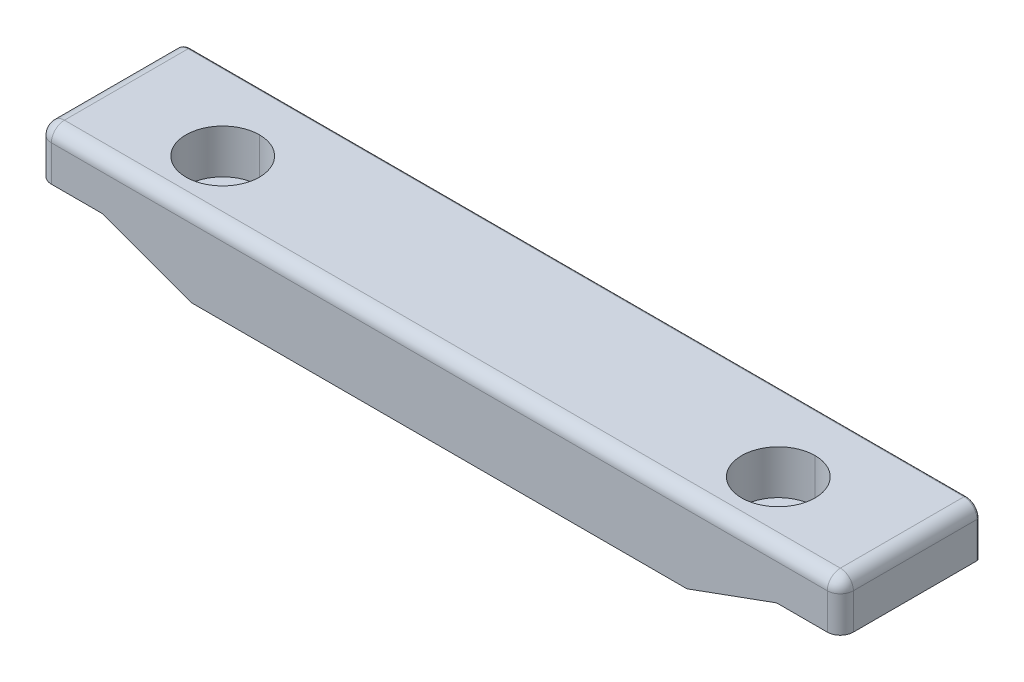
ISO-10303-21;
HEADER;
FILE_DESCRIPTION(('STEP AP214'),'2;1');
FILE_NAME('part.step','',(''),(''),'','','');
FILE_SCHEMA(('AUTOMOTIVE_DESIGN { 1 0 10303 214 1 1 1 1 }'));
ENDSEC;
DATA;
#1=APPLICATION_CONTEXT('core data for automotive mechanical design processes');
#2=APPLICATION_PROTOCOL_DEFINITION('international standard','automotive_design',2000,#1);
#3=PRODUCT_CONTEXT('',#1,'mechanical');
#4=PRODUCT('Part','Part','',(#3));
#5=PRODUCT_RELATED_PRODUCT_CATEGORY('part','',(#4));
#6=PRODUCT_DEFINITION_FORMATION('','',#4);
#7=PRODUCT_DEFINITION_CONTEXT('part definition',#1,'design');
#8=PRODUCT_DEFINITION('design','',#6,#7);
#9=PRODUCT_DEFINITION_SHAPE('','',#8);
#10=(LENGTH_UNIT() NAMED_UNIT(*) SI_UNIT(.MILLI.,.METRE.));
#11=(NAMED_UNIT(*) PLANE_ANGLE_UNIT() SI_UNIT($,.RADIAN.));
#12=(NAMED_UNIT(*) SI_UNIT($,.STERADIAN.) SOLID_ANGLE_UNIT());
#13=UNCERTAINTY_MEASURE_WITH_UNIT(LENGTH_MEASURE(1.E-05),#10,'distance_accuracy_value','');
#14=(GEOMETRIC_REPRESENTATION_CONTEXT(3) GLOBAL_UNCERTAINTY_ASSIGNED_CONTEXT((#13)) GLOBAL_UNIT_ASSIGNED_CONTEXT((#10,
#11,#12)) REPRESENTATION_CONTEXT('',''));
#15=CARTESIAN_POINT('',(0.,0.,0.));
#16=DIRECTION('',(0.,0.,1.));
#17=DIRECTION('',(1.,0.,0.));
#18=AXIS2_PLACEMENT_3D('',#15,#16,#17);
#19=CARTESIAN_POINT('',(-34.05,29.,1.025));
#20=DIRECTION('',(0.,1.,0.));
#21=DIRECTION('',(0.,0.,1.));
#22=AXIS2_PLACEMENT_3D('',#19,#20,#21);
#23=CYLINDRICAL_SURFACE('',#22,4.5);
#24=DIRECTION('',(0.,1.,0.));
#25=VECTOR('',#24,1.);
#26=CARTESIAN_POINT('',(-34.05,29.,-3.475));
#27=LINE('',#26,#25);
#28=CARTESIAN_POINT('',(-34.05,23.6,-3.475));
#29=VERTEX_POINT('',#28);
#30=CARTESIAN_POINT('',(-34.05,29.,-3.475));
#31=VERTEX_POINT('',#30);
#32=EDGE_CURVE('E229',#29,#31,#27,.T.);
#33=ORIENTED_EDGE('',*,*,#32,.F.);
#34=CARTESIAN_POINT('',(-34.05,23.6,1.025));
#35=DIRECTION('',(0.,1.,0.));
#36=DIRECTION('',(0.,0.,1.));
#37=AXIS2_PLACEMENT_3D('',#34,#35,#36);
#38=CIRCLE('',#37,4.5);
#39=CARTESIAN_POINT('',(-34.05,23.6,5.525));
#40=VERTEX_POINT('',#39);
#41=EDGE_CURVE('E10',#40,#29,#38,.T.);
#42=ORIENTED_EDGE('',*,*,#41,.F.);
#43=DIRECTION('',(0.,1.,0.));
#44=VECTOR('',#43,1.);
#45=CARTESIAN_POINT('',(-34.05,29.,5.525));
#46=LINE('',#45,#44);
#47=CARTESIAN_POINT('',(-34.05,29.,5.525));
#48=VERTEX_POINT('',#47);
#49=EDGE_CURVE('E238',#40,#48,#46,.T.);
#50=ORIENTED_EDGE('',*,*,#49,.T.);
#51=CARTESIAN_POINT('',(-34.05,29.,1.025));
#52=DIRECTION('',(0.,1.,0.));
#53=DIRECTION('',(0.,0.,1.));
#54=AXIS2_PLACEMENT_3D('',#51,#52,#53);
#55=CIRCLE('',#54,4.5);
#56=EDGE_CURVE('E230',#48,#31,#55,.T.);
#57=ORIENTED_EDGE('',*,*,#56,.T.);
#58=EDGE_LOOP('',(#33,#42,#50,#57));
#59=FACE_BOUND('',#58,.T.);
#60=ADVANCED_FACE('F15',(#59),#23,.F.);
#61=CARTESIAN_POINT('',(-31.3,23.6,1.025));
#62=DIRECTION('',(0.,-1.,0.));
#63=DIRECTION('',(0.,0.,-1.));
#64=AXIS2_PLACEMENT_3D('',#61,#62,#63);
#65=PLANE('',#64);
#66=CARTESIAN_POINT('',(-34.05,23.6,1.025));
#67=DIRECTION('',(0.,1.,0.));
#68=DIRECTION('',(0.,0.,1.));
#69=AXIS2_PLACEMENT_3D('',#66,#67,#68);
#70=CIRCLE('',#69,2.75);
#71=CARTESIAN_POINT('',(-34.05,23.6,3.775));
#72=VERTEX_POINT('',#71);
#73=CARTESIAN_POINT('',(-34.05,23.6,-1.725));
#74=VERTEX_POINT('',#73);
#75=EDGE_CURVE('E18',#72,#74,#70,.T.);
#76=ORIENTED_EDGE('',*,*,#75,.F.);
#77=CARTESIAN_POINT('',(-34.05,23.6,1.025));
#78=DIRECTION('',(0.,1.,0.));
#79=DIRECTION('',(0.,0.,1.));
#80=AXIS2_PLACEMENT_3D('',#77,#78,#79);
#81=CIRCLE('',#80,2.75);
#82=EDGE_CURVE('E285',#74,#72,#81,.T.);
#83=ORIENTED_EDGE('',*,*,#82,.F.);
#84=EDGE_LOOP('',(#76,#83));
#85=FACE_BOUND('',#84,.T.);
#86=ORIENTED_EDGE('',*,*,#41,.T.);
#87=CARTESIAN_POINT('',(-34.05,23.6,1.025));
#88=DIRECTION('',(0.,1.,0.));
#89=DIRECTION('',(0.,0.,1.));
#90=AXIS2_PLACEMENT_3D('',#87,#88,#89);
#91=CIRCLE('',#90,4.5);
#92=EDGE_CURVE('E224',#29,#40,#91,.T.);
#93=ORIENTED_EDGE('',*,*,#92,.T.);
#94=EDGE_LOOP('',(#86,#93));
#95=FACE_BOUND('',#94,.T.);
#96=ADVANCED_FACE('F222',(#85,#95),#65,.F.);
#97=CARTESIAN_POINT('',(-34.05,29.,1.025));
#98=DIRECTION('',(0.,1.,0.));
#99=DIRECTION('',(0.,0.,1.));
#100=AXIS2_PLACEMENT_3D('',#97,#98,#99);
#101=CYLINDRICAL_SURFACE('',#100,2.75);
#102=DIRECTION('',(0.,1.,0.));
#103=VECTOR('',#102,1.);
#104=CARTESIAN_POINT('',(-34.05,29.,-1.725));
#105=LINE('',#104,#103);
#106=CARTESIAN_POINT('',(-34.05,20.3520107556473,-1.725));
#107=VERTEX_POINT('',#106);
#108=EDGE_CURVE('E273',#107,#74,#105,.T.);
#109=ORIENTED_EDGE('',*,*,#108,.F.);
#110=CARTESIAN_POINT('',(-34.05,20.3520107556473,-1.725));
#111=CARTESIAN_POINT('',(-28.55,18.3501744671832,-1.725));
#112=CARTESIAN_POINT('',(-28.55,18.3501744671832,3.77499999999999));
#113=CARTESIAN_POINT('',(-34.05,20.3520107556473,3.775));
#114=(BOUNDED_CURVE() B_SPLINE_CURVE(3,(#110,#111,#112,#113),.UNSPECIFIED.,.F.,
.F.) B_SPLINE_CURVE_WITH_KNOTS((4,4),(1.5707963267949,4.71238898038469),
.UNSPECIFIED.) CURVE() GEOMETRIC_REPRESENTATION_ITEM() RATIONAL_B_SPLINE_CURVE((1.,
0.333333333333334,0.333333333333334,1.)) REPRESENTATION_ITEM(''));
#115=CARTESIAN_POINT('',(-34.05,20.3520107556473,3.775));
#116=VERTEX_POINT('',#115);
#117=EDGE_CURVE('E492',#107,#116,#114,.T.);
#118=ORIENTED_EDGE('',*,*,#117,.T.);
#119=DIRECTION('',(0.,1.,0.));
#120=VECTOR('',#119,1.);
#121=CARTESIAN_POINT('',(-34.05,29.,3.775));
#122=LINE('',#121,#120);
#123=EDGE_CURVE('E306',#116,#72,#122,.T.);
#124=ORIENTED_EDGE('',*,*,#123,.T.);
#125=ORIENTED_EDGE('',*,*,#75,.T.);
#126=EDGE_LOOP('',(#109,#118,#124,#125));
#127=FACE_BOUND('',#126,.T.);
#128=ADVANCED_FACE('F522',(#127),#101,.F.);
#129=CARTESIAN_POINT('',(34.05,29.,1.025));
#130=DIRECTION('',(0.,1.,0.));
#131=DIRECTION('',(0.,0.,1.));
#132=AXIS2_PLACEMENT_3D('',#129,#130,#131);
#133=CYLINDRICAL_SURFACE('',#132,4.5);
#134=DIRECTION('',(0.,1.,0.));
#135=VECTOR('',#134,1.);
#136=CARTESIAN_POINT('',(34.05,29.,-3.475));
#137=LINE('',#136,#135);
#138=CARTESIAN_POINT('',(34.05,23.6,-3.475));
#139=VERTEX_POINT('',#138);
#140=CARTESIAN_POINT('',(34.05,29.,-3.475));
#141=VERTEX_POINT('',#140);
#142=EDGE_CURVE('E249',#139,#141,#137,.T.);
#143=ORIENTED_EDGE('',*,*,#142,.F.);
#144=CARTESIAN_POINT('',(34.05,23.6,1.025));
#145=DIRECTION('',(0.,1.,0.));
#146=DIRECTION('',(0.,0.,1.));
#147=AXIS2_PLACEMENT_3D('',#144,#145,#146);
#148=CIRCLE('',#147,4.5);
#149=CARTESIAN_POINT('',(34.05,23.6,5.525));
#150=VERTEX_POINT('',#149);
#151=EDGE_CURVE('E383',#150,#139,#148,.T.);
#152=ORIENTED_EDGE('',*,*,#151,.F.);
#153=DIRECTION('',(0.,1.,0.));
#154=VECTOR('',#153,1.);
#155=CARTESIAN_POINT('',(34.05,29.,5.525));
#156=LINE('',#155,#154);
#157=CARTESIAN_POINT('',(34.05,29.,5.525));
#158=VERTEX_POINT('',#157);
#159=EDGE_CURVE('E264',#150,#158,#156,.T.);
#160=ORIENTED_EDGE('',*,*,#159,.T.);
#161=CARTESIAN_POINT('',(34.05,29.,1.025));
#162=DIRECTION('',(0.,1.,0.));
#163=DIRECTION('',(0.,0.,1.));
#164=AXIS2_PLACEMENT_3D('',#161,#162,#163);
#165=CIRCLE('',#164,4.5);
#166=EDGE_CURVE('E469',#158,#141,#165,.T.);
#167=ORIENTED_EDGE('',*,*,#166,.T.);
#168=EDGE_LOOP('',(#143,#152,#160,#167));
#169=FACE_BOUND('',#168,.T.);
#170=ADVANCED_FACE('F621',(#169),#133,.F.);
#171=CARTESIAN_POINT('',(36.8,23.6,1.025));
#172=DIRECTION('',(0.,-1.,0.));
#173=DIRECTION('',(0.,0.,-1.));
#174=AXIS2_PLACEMENT_3D('',#171,#172,#173);
#175=PLANE('',#174);
#176=CARTESIAN_POINT('',(34.05,23.6,1.025));
#177=DIRECTION('',(0.,1.,0.));
#178=DIRECTION('',(0.,0.,1.));
#179=AXIS2_PLACEMENT_3D('',#176,#177,#178);
#180=CIRCLE('',#179,2.75);
#181=CARTESIAN_POINT('',(34.05,23.6,3.775));
#182=VERTEX_POINT('',#181);
#183=CARTESIAN_POINT('',(34.05,23.6,-1.725));
#184=VERTEX_POINT('',#183);
#185=EDGE_CURVE('E380',#182,#184,#180,.T.);
#186=ORIENTED_EDGE('',*,*,#185,.F.);
#187=CARTESIAN_POINT('',(34.05,23.6,1.025));
#188=DIRECTION('',(0.,1.,0.));
#189=DIRECTION('',(0.,0.,1.));
#190=AXIS2_PLACEMENT_3D('',#187,#188,#189);
#191=CIRCLE('',#190,2.75);
#192=EDGE_CURVE('E297',#184,#182,#191,.T.);
#193=ORIENTED_EDGE('',*,*,#192,.F.);
#194=EDGE_LOOP('',(#186,#193));
#195=FACE_BOUND('',#194,.T.);
#196=ORIENTED_EDGE('',*,*,#151,.T.);
#197=CARTESIAN_POINT('',(34.05,23.6,1.025));
#198=DIRECTION('',(0.,1.,0.));
#199=DIRECTION('',(0.,0.,1.));
#200=AXIS2_PLACEMENT_3D('',#197,#198,#199);
#201=CIRCLE('',#200,4.5);
#202=EDGE_CURVE('E254',#139,#150,#201,.T.);
#203=ORIENTED_EDGE('',*,*,#202,.T.);
#204=EDGE_LOOP('',(#196,#203));
#205=FACE_BOUND('',#204,.T.);
#206=ADVANCED_FACE('F626',(#195,#205),#175,.F.);
#207=CARTESIAN_POINT('',(34.05,29.,1.025));
#208=DIRECTION('',(0.,1.,0.));
#209=DIRECTION('',(0.,0.,1.));
#210=AXIS2_PLACEMENT_3D('',#207,#208,#209);
#211=CYLINDRICAL_SURFACE('',#210,2.75);
#212=DIRECTION('',(0.,1.,0.));
#213=VECTOR('',#212,1.);
#214=CARTESIAN_POINT('',(34.05,29.,-1.725));
#215=LINE('',#214,#213);
#216=CARTESIAN_POINT('',(34.05,20.3520107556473,-1.725));
#217=VERTEX_POINT('',#216);
#218=EDGE_CURVE('E293',#217,#184,#215,.T.);
#219=ORIENTED_EDGE('',*,*,#218,.F.);
#220=CARTESIAN_POINT('',(34.05,20.3520107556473,-1.725));
#221=CARTESIAN_POINT('',(39.5499999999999,22.3538470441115,-1.725));
#222=CARTESIAN_POINT('',(39.5499999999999,22.3538470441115,3.77499999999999));
#223=CARTESIAN_POINT('',(34.05,20.3520107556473,3.775));
#224=(BOUNDED_CURVE() B_SPLINE_CURVE(3,(#220,#221,#222,#223),.UNSPECIFIED.,.F.,
.F.) B_SPLINE_CURVE_WITH_KNOTS((4,4),(4.71238898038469,7.85398163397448),
.UNSPECIFIED.) CURVE() GEOMETRIC_REPRESENTATION_ITEM() RATIONAL_B_SPLINE_CURVE((1.,
0.333333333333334,0.333333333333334,1.)) REPRESENTATION_ITEM(''));
#225=CARTESIAN_POINT('',(34.05,20.3520107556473,3.775));
#226=VERTEX_POINT('',#225);
#227=EDGE_CURVE('E384',#217,#226,#224,.T.);
#228=ORIENTED_EDGE('',*,*,#227,.T.);
#229=DIRECTION('',(0.,1.,0.));
#230=VECTOR('',#229,1.);
#231=CARTESIAN_POINT('',(34.05,29.,3.775));
#232=LINE('',#231,#230);
#233=EDGE_CURVE('E310',#226,#182,#232,.T.);
#234=ORIENTED_EDGE('',*,*,#233,.T.);
#235=ORIENTED_EDGE('',*,*,#185,.T.);
#236=EDGE_LOOP('',(#219,#228,#234,#235));
#237=FACE_BOUND('',#236,.T.);
#238=ADVANCED_FACE('F630',(#237),#211,.F.);
#239=CARTESIAN_POINT('',(41.3382898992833,23.0047313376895,-106.906758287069));
#240=DIRECTION('',(0.34202014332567,-0.939692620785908,0.));
#241=DIRECTION('',(0.,0.,-1.));
#242=AXIS2_PLACEMENT_3D('',#239,#240,#241);
#243=PLANE('',#242);
#244=CARTESIAN_POINT('',(34.05,20.3520107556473,3.775));
#245=CARTESIAN_POINT('',(28.55,18.3501744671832,3.77499999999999));
#246=CARTESIAN_POINT('',(28.55,18.3501744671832,-1.725));
#247=CARTESIAN_POINT('',(34.05,20.3520107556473,-1.725));
#248=(BOUNDED_CURVE() B_SPLINE_CURVE(3,(#244,#245,#246,#247),.UNSPECIFIED.,.F.,
.F.) B_SPLINE_CURVE_WITH_KNOTS((4,4),(1.5707963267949,4.71238898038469),
.UNSPECIFIED.) CURVE() GEOMETRIC_REPRESENTATION_ITEM() RATIONAL_B_SPLINE_CURVE((1.,
0.333333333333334,0.333333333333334,1.)) REPRESENTATION_ITEM(''));
#249=EDGE_CURVE('E298',#226,#217,#248,.T.);
#250=ORIENTED_EDGE('',*,*,#249,.F.);
#251=ORIENTED_EDGE('',*,*,#227,.F.);
#252=EDGE_LOOP('',(#250,#251));
#253=FACE_BOUND('',#252,.T.);
#254=DIRECTION('',(0.,0.,1.));
#255=VECTOR('',#254,1.);
#256=CARTESIAN_POINT('',(41.3391183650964,23.0050328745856,-106.906758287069));
#257=LINE('',#256,#255);
#258=CARTESIAN_POINT('',(41.3391183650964,23.0050328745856,-8.525));
#259=VERTEX_POINT('',#258);
#260=CARTESIAN_POINT('',(41.3391183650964,23.0050328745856,8.525));
#261=VERTEX_POINT('',#260);
#262=EDGE_CURVE('E503',#259,#261,#257,.T.);
#263=ORIENTED_EDGE('',*,*,#262,.T.);
#264=DIRECTION('',(0.939692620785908,0.34202014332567,0.));
#265=VECTOR('',#264,1.);
#266=CARTESIAN_POINT('',(41.3382898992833,23.0047313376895,8.525));
#267=LINE('',#266,#265);
#268=CARTESIAN_POINT('',(30.3491183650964,19.005,8.525));
#269=VERTEX_POINT('',#268);
#270=EDGE_CURVE('E375',#269,#261,#267,.T.);
#271=ORIENTED_EDGE('',*,*,#270,.F.);
#272=DIRECTION('',(0.,0.,1.));
#273=VECTOR('',#272,1.);
#274=CARTESIAN_POINT('',(30.3491183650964,19.005,-106.906758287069));
#275=LINE('',#274,#273);
#276=CARTESIAN_POINT('',(30.3491183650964,19.005,-8.525));
#277=VERTEX_POINT('',#276);
#278=EDGE_CURVE('E497',#277,#269,#275,.T.);
#279=ORIENTED_EDGE('',*,*,#278,.F.);
#280=DIRECTION('',(-0.939692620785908,-0.34202014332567,0.));
#281=VECTOR('',#280,1.);
#282=CARTESIAN_POINT('',(41.3382898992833,23.0047313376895,-8.525));
#283=LINE('',#282,#281);
#284=EDGE_CURVE('E282',#259,#277,#283,.T.);
#285=ORIENTED_EDGE('',*,*,#284,.F.);
#286=EDGE_LOOP('',(#263,#271,#279,#285));
#287=FACE_BOUND('',#286,.T.);
#288=ADVANCED_FACE('F555',(#253,#287),#243,.T.);
#289=CARTESIAN_POINT('',(49.15,23.0050328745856,-106.906758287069));
#290=DIRECTION('',(0.,-1.,0.));
#291=DIRECTION('',(0.,0.,-1.));
#292=AXIS2_PLACEMENT_3D('',#289,#290,#291);
#293=PLANE('',#292);
#294=DIRECTION('',(1.,0.,0.));
#295=VECTOR('',#294,1.);
#296=CARTESIAN_POINT('',(49.15,23.0050328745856,8.525));
#297=LINE('',#296,#295);
#298=CARTESIAN_POINT('',(47.55,23.0050328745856,8.525));
#299=VERTEX_POINT('',#298);
#300=EDGE_CURVE('E379',#261,#299,#297,.T.);
#301=ORIENTED_EDGE('',*,*,#300,.F.);
#302=ORIENTED_EDGE('',*,*,#262,.F.);
#303=DIRECTION('',(-1.,0.,0.));
#304=VECTOR('',#303,1.);
#305=CARTESIAN_POINT('',(49.15,23.0050328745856,-8.525));
#306=LINE('',#305,#304);
#307=CARTESIAN_POINT('',(48.85,23.0050328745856,-8.525));
#308=VERTEX_POINT('',#307);
#309=EDGE_CURVE('E258',#308,#259,#306,.T.);
#310=ORIENTED_EDGE('',*,*,#309,.F.);
#311=CARTESIAN_POINT('',(48.85,23.0050328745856,-8.225));
#312=DIRECTION('',(0.,1.,0.));
#313=DIRECTION('',(1.,0.,0.));
#314=AXIS2_PLACEMENT_3D('',#311,#312,#313);
#315=CIRCLE('',#314,0.3);
#316=CARTESIAN_POINT('',(49.15,23.0050328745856,-8.225));
#317=VERTEX_POINT('',#316);
#318=EDGE_CURVE('E444',#317,#308,#315,.T.);
#319=ORIENTED_EDGE('',*,*,#318,.F.);
#320=DIRECTION('',(0.,0.,1.));
#321=VECTOR('',#320,1.);
#322=CARTESIAN_POINT('',(49.15,23.0050328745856,-106.906758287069));
#323=LINE('',#322,#321);
#324=CARTESIAN_POINT('',(49.15,23.0050328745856,6.925));
#325=VERTEX_POINT('',#324);
#326=EDGE_CURVE('E359',#317,#325,#323,.T.);
#327=ORIENTED_EDGE('',*,*,#326,.T.);
#328=CARTESIAN_POINT('',(47.55,23.0050328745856,6.925));
#329=DIRECTION('',(0.,1.,0.));
#330=DIRECTION('',(1.,0.,0.));
#331=AXIS2_PLACEMENT_3D('',#328,#329,#330);
#332=CIRCLE('',#331,1.6);
#333=EDGE_CURVE('E292',#299,#325,#332,.T.);
#334=ORIENTED_EDGE('',*,*,#333,.F.);
#335=EDGE_LOOP('',(#301,#302,#310,#319,#327,#334));
#336=FACE_BOUND('',#335,.T.);
#337=ADVANCED_FACE('F559',(#336),#293,.T.);
#338=CARTESIAN_POINT('',(-30.35,19.005,-106.906758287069));
#339=DIRECTION('',(0.,-1.,0.));
#340=DIRECTION('',(0.,0.,-1.));
#341=AXIS2_PLACEMENT_3D('',#338,#339,#340);
#342=PLANE('',#341);
#343=ORIENTED_EDGE('',*,*,#278,.T.);
#344=DIRECTION('',(1.,0.,0.));
#345=VECTOR('',#344,1.);
#346=CARTESIAN_POINT('',(-30.35,19.005,8.525));
#347=LINE('',#346,#345);
#348=CARTESIAN_POINT('',(-30.3491183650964,19.005,8.525));
#349=VERTEX_POINT('',#348);
#350=EDGE_CURVE('E246',#349,#269,#347,.T.);
#351=ORIENTED_EDGE('',*,*,#350,.F.);
#352=DIRECTION('',(0.,0.,1.));
#353=VECTOR('',#352,1.);
#354=CARTESIAN_POINT('',(-30.3491183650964,19.005,-106.906758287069));
#355=LINE('',#354,#353);
#356=CARTESIAN_POINT('',(-30.3491183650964,19.005,-8.525));
#357=VERTEX_POINT('',#356);
#358=EDGE_CURVE('E440',#357,#349,#355,.T.);
#359=ORIENTED_EDGE('',*,*,#358,.F.);
#360=DIRECTION('',(-1.,0.,0.));
#361=VECTOR('',#360,1.);
#362=CARTESIAN_POINT('',(-30.35,19.005,-8.525));
#363=LINE('',#362,#361);
#364=EDGE_CURVE('E274',#277,#357,#363,.T.);
#365=ORIENTED_EDGE('',*,*,#364,.F.);
#366=EDGE_LOOP('',(#343,#351,#359,#365));
#367=FACE_BOUND('',#366,.T.);
#368=ADVANCED_FACE('F533',(#367),#342,.T.);
#369=CARTESIAN_POINT('',(-41.3382898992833,23.0047313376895,-106.906758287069));
#370=DIRECTION('',(-0.34202014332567,-0.939692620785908,0.));
#371=DIRECTION('',(-0.939692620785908,0.34202014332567,0.));
#372=AXIS2_PLACEMENT_3D('',#369,#370,#371);
#373=PLANE('',#372);
#374=CARTESIAN_POINT('',(-34.05,20.3520107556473,3.775));
#375=CARTESIAN_POINT('',(-39.5499999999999,22.3538470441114,3.77499999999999));
#376=CARTESIAN_POINT('',(-39.5499999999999,22.3538470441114,-1.725));
#377=CARTESIAN_POINT('',(-34.05,20.3520107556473,-1.725));
#378=(BOUNDED_CURVE() B_SPLINE_CURVE(3,(#374,#375,#376,#377),.UNSPECIFIED.,.F.,
.F.) B_SPLINE_CURVE_WITH_KNOTS((4,4),(4.71238898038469,7.85398163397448),
.UNSPECIFIED.) CURVE() GEOMETRIC_REPRESENTATION_ITEM() RATIONAL_B_SPLINE_CURVE((1.,
0.333333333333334,0.333333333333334,1.)) REPRESENTATION_ITEM(''));
#379=EDGE_CURVE('E267',#116,#107,#378,.T.);
#380=ORIENTED_EDGE('',*,*,#379,.F.);
#381=ORIENTED_EDGE('',*,*,#117,.F.);
#382=EDGE_LOOP('',(#380,#381));
#383=FACE_BOUND('',#382,.T.);
#384=ORIENTED_EDGE('',*,*,#358,.T.);
#385=DIRECTION('',(0.939692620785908,-0.34202014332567,0.));
#386=VECTOR('',#385,1.);
#387=CARTESIAN_POINT('',(-41.3382898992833,23.0047313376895,8.525));
#388=LINE('',#387,#386);
#389=CARTESIAN_POINT('',(-41.3391183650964,23.0050328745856,8.525));
#390=VERTEX_POINT('',#389);
#391=EDGE_CURVE('E244',#390,#349,#388,.T.);
#392=ORIENTED_EDGE('',*,*,#391,.F.);
#393=DIRECTION('',(0.,0.,1.));
#394=VECTOR('',#393,1.);
#395=CARTESIAN_POINT('',(-41.3391183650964,23.0050328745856,-106.906758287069));
#396=LINE('',#395,#394);
#397=CARTESIAN_POINT('',(-41.3391183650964,23.0050328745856,-8.525));
#398=VERTEX_POINT('',#397);
#399=EDGE_CURVE('E437',#398,#390,#396,.T.);
#400=ORIENTED_EDGE('',*,*,#399,.F.);
#401=DIRECTION('',(-0.939692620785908,0.34202014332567,0.));
#402=VECTOR('',#401,1.);
#403=CARTESIAN_POINT('',(-41.3382898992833,23.0047313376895,-8.525));
#404=LINE('',#403,#402);
#405=EDGE_CURVE('E281',#357,#398,#404,.T.);
#406=ORIENTED_EDGE('',*,*,#405,.F.);
#407=EDGE_LOOP('',(#384,#392,#400,#406));
#408=FACE_BOUND('',#407,.T.);
#409=ADVANCED_FACE('F529',(#383,#408),#373,.T.);
#410=CARTESIAN_POINT('',(-49.15,23.0050328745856,-106.906758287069));
#411=DIRECTION('',(0.,-1.,0.));
#412=DIRECTION('',(-1.,0.,0.));
#413=AXIS2_PLACEMENT_3D('',#410,#411,#412);
#414=PLANE('',#413);
#415=DIRECTION('',(0.,0.,1.));
#416=VECTOR('',#415,1.);
#417=CARTESIAN_POINT('',(-49.15,23.0050328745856,-106.906758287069));
#418=LINE('',#417,#416);
#419=CARTESIAN_POINT('',(-49.15,23.0050328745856,-8.225));
#420=VERTEX_POINT('',#419);
#421=CARTESIAN_POINT('',(-49.15,23.0050328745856,6.925));
#422=VERTEX_POINT('',#421);
#423=EDGE_CURVE('E340',#420,#422,#418,.T.);
#424=ORIENTED_EDGE('',*,*,#423,.F.);
#425=CARTESIAN_POINT('',(-48.85,23.0050328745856,-8.225));
#426=DIRECTION('',(0.,1.,0.));
#427=DIRECTION('',(1.,0.,0.));
#428=AXIS2_PLACEMENT_3D('',#425,#426,#427);
#429=CIRCLE('',#428,0.3);
#430=CARTESIAN_POINT('',(-48.85,23.0050328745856,-8.525));
#431=VERTEX_POINT('',#430);
#432=EDGE_CURVE('E336',#431,#420,#429,.T.);
#433=ORIENTED_EDGE('',*,*,#432,.F.);
#434=DIRECTION('',(-1.,0.,0.));
#435=VECTOR('',#434,1.);
#436=CARTESIAN_POINT('',(-49.15,23.0050328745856,-8.525));
#437=LINE('',#436,#435);
#438=EDGE_CURVE('E302',#398,#431,#437,.T.);
#439=ORIENTED_EDGE('',*,*,#438,.F.);
#440=ORIENTED_EDGE('',*,*,#399,.T.);
#441=DIRECTION('',(1.,0.,0.));
#442=VECTOR('',#441,1.);
#443=CARTESIAN_POINT('',(-49.15,23.0050328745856,8.525));
#444=LINE('',#443,#442);
#445=CARTESIAN_POINT('',(-47.55,23.0050328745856,8.525));
#446=VERTEX_POINT('',#445);
#447=EDGE_CURVE('E247',#446,#390,#444,.T.);
#448=ORIENTED_EDGE('',*,*,#447,.F.);
#449=CARTESIAN_POINT('',(-47.55,23.0050328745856,6.925));
#450=DIRECTION('',(0.,1.,0.));
#451=DIRECTION('',(1.,0.,0.));
#452=AXIS2_PLACEMENT_3D('',#449,#450,#451);
#453=CIRCLE('',#452,1.6);
#454=EDGE_CURVE('E291',#422,#446,#453,.T.);
#455=ORIENTED_EDGE('',*,*,#454,.F.);
#456=EDGE_LOOP('',(#424,#433,#439,#440,#448,#455));
#457=FACE_BOUND('',#456,.T.);
#458=ADVANCED_FACE('F532',(#457),#414,.T.);
#459=CARTESIAN_POINT('',(47.55,27.4,-8.225));
#460=DIRECTION('',(0.,0.,1.));
#461=DIRECTION('',(1.,0.,0.));
#462=AXIS2_PLACEMENT_3D('',#459,#460,#461);
#463=TOROIDAL_SURFACE('',#462,1.3,0.3);
#464=CARTESIAN_POINT('',(47.55,28.7,-8.225));
#465=DIRECTION('',(1.,0.,0.));
#466=DIRECTION('',(0.,0.,-1.));
#467=AXIS2_PLACEMENT_3D('',#464,#465,#466);
#468=CIRCLE('',#467,0.3);
#469=CARTESIAN_POINT('',(47.55,28.7,-8.525));
#470=VERTEX_POINT('',#469);
#471=CARTESIAN_POINT('',(47.55,29.,-8.225));
#472=VERTEX_POINT('',#471);
#473=EDGE_CURVE('E441',#470,#472,#468,.T.);
#474=ORIENTED_EDGE('',*,*,#473,.T.);
#475=CARTESIAN_POINT('',(47.55,27.4,-8.225));
#476=DIRECTION('',(0.,0.,1.));
#477=DIRECTION('',(1.,0.,0.));
#478=AXIS2_PLACEMENT_3D('',#475,#476,#477);
#479=CIRCLE('',#478,1.6);
#480=CARTESIAN_POINT('',(49.15,27.4,-8.225));
#481=VERTEX_POINT('',#480);
#482=EDGE_CURVE('E472',#481,#472,#479,.T.);
#483=ORIENTED_EDGE('',*,*,#482,.F.);
#484=CARTESIAN_POINT('',(48.85,27.4,-8.225));
#485=DIRECTION('',(0.,-1.,0.));
#486=DIRECTION('',(0.,0.,-1.));
#487=AXIS2_PLACEMENT_3D('',#484,#485,#486);
#488=CIRCLE('',#487,0.3);
#489=CARTESIAN_POINT('',(48.85,27.4,-8.525));
#490=VERTEX_POINT('',#489);
#491=EDGE_CURVE('E447',#490,#481,#488,.T.);
#492=ORIENTED_EDGE('',*,*,#491,.F.);
#493=CARTESIAN_POINT('',(47.55,27.4,-8.525));
#494=DIRECTION('',(0.,0.,-1.));
#495=DIRECTION('',(1.,0.,0.));
#496=AXIS2_PLACEMENT_3D('',#493,#494,#495);
#497=CIRCLE('',#496,1.3);
#498=EDGE_CURVE('E425',#470,#490,#497,.T.);
#499=ORIENTED_EDGE('',*,*,#498,.F.);
#500=EDGE_LOOP('',(#474,#483,#492,#499));
#501=FACE_BOUND('',#500,.T.);
#502=ADVANCED_FACE('F587',(#501),#463,.T.);
#503=CARTESIAN_POINT('',(-49.15,28.7,-8.225));
#504=DIRECTION('',(-1.,0.,0.));
#505=DIRECTION('',(0.,0.,1.));
#506=AXIS2_PLACEMENT_3D('',#503,#504,#505);
#507=CYLINDRICAL_SURFACE('',#506,0.3);
#508=CARTESIAN_POINT('',(-47.55,28.7,-8.225));
#509=DIRECTION('',(1.,0.,0.));
#510=DIRECTION('',(0.,0.,-1.));
#511=AXIS2_PLACEMENT_3D('',#508,#509,#510);
#512=CIRCLE('',#511,0.3);
#513=CARTESIAN_POINT('',(-47.55,28.7,-8.525));
#514=VERTEX_POINT('',#513);
#515=CARTESIAN_POINT('',(-47.55,29.,-8.225));
#516=VERTEX_POINT('',#515);
#517=EDGE_CURVE('E45',#514,#516,#512,.T.);
#518=ORIENTED_EDGE('',*,*,#517,.T.);
#519=DIRECTION('',(-1.,0.,0.));
#520=VECTOR('',#519,1.);
#521=CARTESIAN_POINT('',(-49.15,29.,-8.225));
#522=LINE('',#521,#520);
#523=EDGE_CURVE('E455',#472,#516,#522,.T.);
#524=ORIENTED_EDGE('',*,*,#523,.F.);
#525=ORIENTED_EDGE('',*,*,#473,.F.);
#526=DIRECTION('',(1.,0.,0.));
#527=VECTOR('',#526,1.);
#528=CARTESIAN_POINT('',(0.,28.7,-8.525));
#529=LINE('',#528,#527);
#530=EDGE_CURVE('E416',#514,#470,#529,.T.);
#531=ORIENTED_EDGE('',*,*,#530,.F.);
#532=EDGE_LOOP('',(#518,#524,#525,#531));
#533=FACE_BOUND('',#532,.T.);
#534=ADVANCED_FACE('F584',(#533),#507,.T.);
#535=CARTESIAN_POINT('',(-47.55,27.4,-8.225));
#536=DIRECTION('',(0.,0.,1.));
#537=DIRECTION('',(1.,0.,0.));
#538=AXIS2_PLACEMENT_3D('',#535,#536,#537);
#539=TOROIDAL_SURFACE('',#538,1.3,0.3);
#540=CARTESIAN_POINT('',(-48.85,27.4,-8.225));
#541=DIRECTION('',(0.,-1.,0.));
#542=DIRECTION('',(0.,0.,-1.));
#543=AXIS2_PLACEMENT_3D('',#540,#541,#542);
#544=CIRCLE('',#543,0.3);
#545=CARTESIAN_POINT('',(-49.15,27.4,-8.225));
#546=VERTEX_POINT('',#545);
#547=CARTESIAN_POINT('',(-48.85,27.4,-8.525));
#548=VERTEX_POINT('',#547);
#549=EDGE_CURVE('E343',#546,#548,#544,.T.);
#550=ORIENTED_EDGE('',*,*,#549,.F.);
#551=CARTESIAN_POINT('',(-47.55,27.4,-8.225));
#552=DIRECTION('',(0.,0.,1.));
#553=DIRECTION('',(1.,0.,0.));
#554=AXIS2_PLACEMENT_3D('',#551,#552,#553);
#555=CIRCLE('',#554,1.6);
#556=EDGE_CURVE('E420',#516,#546,#555,.T.);
#557=ORIENTED_EDGE('',*,*,#556,.F.);
#558=ORIENTED_EDGE('',*,*,#517,.F.);
#559=CARTESIAN_POINT('',(-47.55,27.4,-8.525));
#560=DIRECTION('',(0.,0.,-1.));
#561=DIRECTION('',(1.,0.,0.));
#562=AXIS2_PLACEMENT_3D('',#559,#560,#561);
#563=CIRCLE('',#562,1.3);
#564=EDGE_CURVE('E412',#548,#514,#563,.T.);
#565=ORIENTED_EDGE('',*,*,#564,.F.);
#566=EDGE_LOOP('',(#550,#557,#558,#565));
#567=FACE_BOUND('',#566,.T.);
#568=ADVANCED_FACE('F582',(#567),#539,.T.);
#569=CARTESIAN_POINT('',(-47.55,27.4,6.925));
#570=DIRECTION('',(0.,1.,0.));
#571=DIRECTION('',(1.,0.,0.));
#572=AXIS2_PLACEMENT_3D('',#569,#570,#571);
#573=SPHERICAL_SURFACE('',#572,1.6);
#574=CARTESIAN_POINT('',(-47.55,27.4,6.925));
#575=DIRECTION('',(-1.,0.,0.));
#576=DIRECTION('',(0.,-1.,0.));
#577=AXIS2_PLACEMENT_3D('',#574,#575,#576);
#578=CIRCLE('',#577,1.6);
#579=CARTESIAN_POINT('',(-47.55,27.4,8.525));
#580=VERTEX_POINT('',#579);
#581=CARTESIAN_POINT('',(-47.55,29.,6.925));
#582=VERTEX_POINT('',#581);
#583=EDGE_CURVE('E35',#580,#582,#578,.T.);
#584=ORIENTED_EDGE('',*,*,#583,.T.);
#585=CARTESIAN_POINT('',(-47.55,27.4,6.925));
#586=DIRECTION('',(0.,0.,1.));
#587=DIRECTION('',(1.,0.,0.));
#588=AXIS2_PLACEMENT_3D('',#585,#586,#587);
#589=CIRCLE('',#588,1.6);
#590=CARTESIAN_POINT('',(-49.15,27.4,6.925));
#591=VERTEX_POINT('',#590);
#592=EDGE_CURVE('E481',#582,#591,#589,.T.);
#593=ORIENTED_EDGE('',*,*,#592,.T.);
#594=CARTESIAN_POINT('',(-47.55,27.4,6.925));
#595=DIRECTION('',(0.,-1.,0.));
#596=DIRECTION('',(0.,0.,1.));
#597=AXIS2_PLACEMENT_3D('',#594,#595,#596);
#598=CIRCLE('',#597,1.6);
#599=EDGE_CURVE('E329',#580,#591,#598,.T.);
#600=ORIENTED_EDGE('',*,*,#599,.F.);
#601=EDGE_LOOP('',(#584,#593,#600));
#602=FACE_BOUND('',#601,.T.);
#603=ADVANCED_FACE('F570',(#602),#573,.T.);
#604=CARTESIAN_POINT('',(0.,27.4,6.925));
#605=DIRECTION('',(1.,0.,0.));
#606=DIRECTION('',(0.,0.,-1.));
#607=AXIS2_PLACEMENT_3D('',#604,#605,#606);
#608=CYLINDRICAL_SURFACE('',#607,1.6);
#609=CARTESIAN_POINT('',(47.55,27.4,6.925));
#610=DIRECTION('',(-1.,0.,0.));
#611=DIRECTION('',(0.,0.,-1.));
#612=AXIS2_PLACEMENT_3D('',#609,#610,#611);
#613=CIRCLE('',#612,1.6);
#614=CARTESIAN_POINT('',(47.55,27.4,8.525));
#615=VERTEX_POINT('',#614);
#616=CARTESIAN_POINT('',(47.55,29.,6.925));
#617=VERTEX_POINT('',#616);
#618=EDGE_CURVE('E417',#615,#617,#613,.T.);
#619=ORIENTED_EDGE('',*,*,#618,.T.);
#620=DIRECTION('',(1.,0.,0.));
#621=VECTOR('',#620,1.);
#622=CARTESIAN_POINT('',(49.15,29.,6.925));
#623=LINE('',#622,#621);
#624=EDGE_CURVE('E463',#582,#617,#623,.T.);
#625=ORIENTED_EDGE('',*,*,#624,.F.);
#626=ORIENTED_EDGE('',*,*,#583,.F.);
#627=DIRECTION('',(-1.,0.,0.));
#628=VECTOR('',#627,1.);
#629=CARTESIAN_POINT('',(-49.15,27.4,8.525));
#630=LINE('',#629,#628);
#631=EDGE_CURVE('E392',#615,#580,#630,.T.);
#632=ORIENTED_EDGE('',*,*,#631,.F.);
#633=EDGE_LOOP('',(#619,#625,#626,#632));
#634=FACE_BOUND('',#633,.T.);
#635=ADVANCED_FACE('F568',(#634),#608,.T.);
#636=CARTESIAN_POINT('',(-47.55,27.4,8.525));
#637=DIRECTION('',(0.,0.,-1.));
#638=DIRECTION('',(-1.,0.,0.));
#639=AXIS2_PLACEMENT_3D('',#636,#637,#638);
#640=CYLINDRICAL_SURFACE('',#639,1.6);
#641=DIRECTION('',(0.,0.,1.));
#642=VECTOR('',#641,1.);
#643=CARTESIAN_POINT('',(-47.55,29.,8.525));
#644=LINE('',#643,#642);
#645=EDGE_CURVE('E459',#516,#582,#644,.T.);
#646=ORIENTED_EDGE('',*,*,#645,.F.);
#647=ORIENTED_EDGE('',*,*,#556,.T.);
#648=DIRECTION('',(0.,0.,-1.));
#649=VECTOR('',#648,1.);
#650=CARTESIAN_POINT('',(-49.15,27.4,8.525));
#651=LINE('',#650,#649);
#652=EDGE_CURVE('E351',#591,#546,#651,.T.);
#653=ORIENTED_EDGE('',*,*,#652,.F.);
#654=ORIENTED_EDGE('',*,*,#592,.F.);
#655=EDGE_LOOP('',(#646,#647,#653,#654));
#656=FACE_BOUND('',#655,.T.);
#657=ADVANCED_FACE('F602',(#656),#640,.T.);
#658=CARTESIAN_POINT('',(47.55,27.4,6.925));
#659=DIRECTION('',(0.,1.,0.));
#660=DIRECTION('',(1.,0.,0.));
#661=AXIS2_PLACEMENT_3D('',#658,#659,#660);
#662=SPHERICAL_SURFACE('',#661,1.6);
#663=CARTESIAN_POINT('',(47.55,27.4,6.925));
#664=DIRECTION('',(0.,-1.,0.));
#665=DIRECTION('',(0.,0.,1.));
#666=AXIS2_PLACEMENT_3D('',#663,#664,#665);
#667=CIRCLE('',#666,1.6);
#668=CARTESIAN_POINT('',(49.15,27.4,6.925));
#669=VERTEX_POINT('',#668);
#670=EDGE_CURVE('E287',#669,#615,#667,.T.);
#671=ORIENTED_EDGE('',*,*,#670,.F.);
#672=CARTESIAN_POINT('',(47.55,27.4,6.925));
#673=DIRECTION('',(0.,0.,1.));
#674=DIRECTION('',(1.,0.,0.));
#675=AXIS2_PLACEMENT_3D('',#672,#673,#674);
#676=CIRCLE('',#675,1.6);
#677=EDGE_CURVE('E421',#669,#617,#676,.T.);
#678=ORIENTED_EDGE('',*,*,#677,.T.);
#679=ORIENTED_EDGE('',*,*,#618,.F.);
#680=EDGE_LOOP('',(#671,#678,#679));
#681=FACE_BOUND('',#680,.T.);
#682=ADVANCED_FACE('F598',(#681),#662,.T.);
#683=CARTESIAN_POINT('',(47.55,27.4,8.525));
#684=DIRECTION('',(0.,0.,-1.));
#685=DIRECTION('',(-1.,0.,0.));
#686=AXIS2_PLACEMENT_3D('',#683,#684,#685);
#687=CYLINDRICAL_SURFACE('',#686,1.6);
#688=DIRECTION('',(0.,0.,1.));
#689=VECTOR('',#688,1.);
#690=CARTESIAN_POINT('',(49.15,27.4,8.525));
#691=LINE('',#690,#689);
#692=EDGE_CURVE('E367',#481,#669,#691,.T.);
#693=ORIENTED_EDGE('',*,*,#692,.F.);
#694=ORIENTED_EDGE('',*,*,#482,.T.);
#695=DIRECTION('',(0.,0.,-1.));
#696=VECTOR('',#695,1.);
#697=CARTESIAN_POINT('',(47.55,29.,8.525));
#698=LINE('',#697,#696);
#699=EDGE_CURVE('E451',#617,#472,#698,.T.);
#700=ORIENTED_EDGE('',*,*,#699,.F.);
#701=ORIENTED_EDGE('',*,*,#677,.F.);
#702=EDGE_LOOP('',(#693,#694,#700,#701));
#703=FACE_BOUND('',#702,.T.);
#704=ADVANCED_FACE('F596',(#703),#687,.T.);
#705=CARTESIAN_POINT('',(-49.15,29.,8.525));
#706=DIRECTION('',(0.,-1.,0.));
#707=DIRECTION('',(0.,0.,-1.));
#708=AXIS2_PLACEMENT_3D('',#705,#706,#707);
#709=PLANE('',#708);
#710=ORIENTED_EDGE('',*,*,#166,.F.);
#711=CARTESIAN_POINT('',(34.05,29.,1.025));
#712=DIRECTION('',(0.,1.,0.));
#713=DIRECTION('',(0.,0.,1.));
#714=AXIS2_PLACEMENT_3D('',#711,#712,#713);
#715=CIRCLE('',#714,4.5);
#716=EDGE_CURVE('E253',#141,#158,#715,.T.);
#717=ORIENTED_EDGE('',*,*,#716,.F.);
#718=EDGE_LOOP('',(#710,#717));
#719=FACE_BOUND('',#718,.T.);
#720=ORIENTED_EDGE('',*,*,#56,.F.);
#721=CARTESIAN_POINT('',(-34.05,29.,1.025));
#722=DIRECTION('',(0.,1.,0.));
#723=DIRECTION('',(0.,0.,1.));
#724=AXIS2_PLACEMENT_3D('',#721,#722,#723);
#725=CIRCLE('',#724,4.5);
#726=EDGE_CURVE('E235',#31,#48,#725,.T.);
#727=ORIENTED_EDGE('',*,*,#726,.F.);
#728=EDGE_LOOP('',(#720,#727));
#729=FACE_BOUND('',#728,.T.);
#730=ORIENTED_EDGE('',*,*,#699,.T.);
#731=ORIENTED_EDGE('',*,*,#523,.T.);
#732=ORIENTED_EDGE('',*,*,#645,.T.);
#733=ORIENTED_EDGE('',*,*,#624,.T.);
#734=EDGE_LOOP('',(#730,#731,#732,#733));
#735=FACE_BOUND('',#734,.T.);
#736=ADVANCED_FACE('F600',(#719,#729,#735),#709,.F.);
#737=CARTESIAN_POINT('',(48.85,29.,-8.225));
#738=DIRECTION('',(0.,1.,0.));
#739=DIRECTION('',(0.,0.,1.));
#740=AXIS2_PLACEMENT_3D('',#737,#738,#739);
#741=CYLINDRICAL_SURFACE('',#740,0.3);
#742=DIRECTION('',(0.,1.,0.));
#743=VECTOR('',#742,1.);
#744=CARTESIAN_POINT('',(49.15,29.,-8.225));
#745=LINE('',#744,#743);
#746=EDGE_CURVE('E363',#317,#481,#745,.T.);
#747=ORIENTED_EDGE('',*,*,#746,.F.);
#748=ORIENTED_EDGE('',*,*,#318,.T.);
#749=DIRECTION('',(0.,-1.,0.));
#750=VECTOR('',#749,1.);
#751=CARTESIAN_POINT('',(48.85,0.,-8.525));
#752=LINE('',#751,#750);
#753=EDGE_CURVE('E429',#490,#308,#752,.T.);
#754=ORIENTED_EDGE('',*,*,#753,.F.);
#755=ORIENTED_EDGE('',*,*,#491,.T.);
#756=EDGE_LOOP('',(#747,#748,#754,#755));
#757=FACE_BOUND('',#756,.T.);
#758=ADVANCED_FACE('F591',(#757),#741,.T.);
#759=CARTESIAN_POINT('',(-48.85,29.,-8.225));
#760=DIRECTION('',(0.,-1.,0.));
#761=DIRECTION('',(1.,0.,0.));
#762=AXIS2_PLACEMENT_3D('',#759,#760,#761);
#763=CYLINDRICAL_SURFACE('',#762,0.3);
#764=DIRECTION('',(0.,1.,0.));
#765=VECTOR('',#764,1.);
#766=CARTESIAN_POINT('',(-48.85,0.,-8.525));
#767=LINE('',#766,#765);
#768=EDGE_CURVE('E314',#431,#548,#767,.T.);
#769=ORIENTED_EDGE('',*,*,#768,.F.);
#770=ORIENTED_EDGE('',*,*,#432,.T.);
#771=DIRECTION('',(0.,-1.,0.));
#772=VECTOR('',#771,1.);
#773=CARTESIAN_POINT('',(-49.15,29.,-8.225));
#774=LINE('',#773,#772);
#775=EDGE_CURVE('E355',#546,#420,#774,.T.);
#776=ORIENTED_EDGE('',*,*,#775,.F.);
#777=ORIENTED_EDGE('',*,*,#549,.T.);
#778=EDGE_LOOP('',(#769,#770,#776,#777));
#779=FACE_BOUND('',#778,.T.);
#780=ADVANCED_FACE('F578',(#779),#763,.T.);
#781=CARTESIAN_POINT('',(-47.55,0.,6.925));
#782=DIRECTION('',(0.,1.,0.));
#783=DIRECTION('',(-1.,0.,0.));
#784=AXIS2_PLACEMENT_3D('',#781,#782,#783);
#785=CYLINDRICAL_SURFACE('',#784,1.6);
#786=DIRECTION('',(0.,1.,0.));
#787=VECTOR('',#786,1.);
#788=CARTESIAN_POINT('',(-49.15,29.,6.925));
#789=LINE('',#788,#787);
#790=EDGE_CURVE('E347',#422,#591,#789,.T.);
#791=ORIENTED_EDGE('',*,*,#790,.F.);
#792=ORIENTED_EDGE('',*,*,#454,.T.);
#793=DIRECTION('',(0.,-1.,0.));
#794=VECTOR('',#793,1.);
#795=CARTESIAN_POINT('',(-47.55,-29.,8.525));
#796=LINE('',#795,#794);
#797=EDGE_CURVE('E396',#580,#446,#796,.T.);
#798=ORIENTED_EDGE('',*,*,#797,.F.);
#799=ORIENTED_EDGE('',*,*,#599,.T.);
#800=EDGE_LOOP('',(#791,#792,#798,#799));
#801=FACE_BOUND('',#800,.T.);
#802=ADVANCED_FACE('F573',(#801),#785,.T.);
#803=CARTESIAN_POINT('',(47.55,0.,6.925));
#804=DIRECTION('',(0.,-1.,0.));
#805=DIRECTION('',(0.,0.,-1.));
#806=AXIS2_PLACEMENT_3D('',#803,#804,#805);
#807=CYLINDRICAL_SURFACE('',#806,1.6);
#808=DIRECTION('',(0.,1.,0.));
#809=VECTOR('',#808,1.);
#810=CARTESIAN_POINT('',(47.55,29.,8.525));
#811=LINE('',#810,#809);
#812=EDGE_CURVE('E388',#299,#615,#811,.T.);
#813=ORIENTED_EDGE('',*,*,#812,.F.);
#814=ORIENTED_EDGE('',*,*,#333,.T.);
#815=DIRECTION('',(0.,-1.,0.));
#816=VECTOR('',#815,1.);
#817=CARTESIAN_POINT('',(49.15,-29.,6.925));
#818=LINE('',#817,#816);
#819=EDGE_CURVE('E371',#669,#325,#818,.T.);
#820=ORIENTED_EDGE('',*,*,#819,.F.);
#821=ORIENTED_EDGE('',*,*,#670,.T.);
#822=EDGE_LOOP('',(#813,#814,#820,#821));
#823=FACE_BOUND('',#822,.T.);
#824=ADVANCED_FACE('F563',(#823),#807,.T.);
#825=CARTESIAN_POINT('',(0.,0.,-8.525));
#826=DIRECTION('',(0.,0.,1.));
#827=DIRECTION('',(1.,0.,0.));
#828=AXIS2_PLACEMENT_3D('',#825,#826,#827);
#829=PLANE('',#828);
#830=ORIENTED_EDGE('',*,*,#309,.T.);
#831=ORIENTED_EDGE('',*,*,#284,.T.);
#832=ORIENTED_EDGE('',*,*,#364,.T.);
#833=ORIENTED_EDGE('',*,*,#405,.T.);
#834=ORIENTED_EDGE('',*,*,#438,.T.);
#835=ORIENTED_EDGE('',*,*,#768,.T.);
#836=ORIENTED_EDGE('',*,*,#564,.T.);
#837=ORIENTED_EDGE('',*,*,#530,.T.);
#838=ORIENTED_EDGE('',*,*,#498,.T.);
#839=ORIENTED_EDGE('',*,*,#753,.T.);
#840=EDGE_LOOP('',(#830,#831,#832,#833,#834,#835,#836,#837,#838,#839));
#841=FACE_BOUND('',#840,.T.);
#842=ADVANCED_FACE('F551',(#841),#829,.F.);
#843=CARTESIAN_POINT('',(0.,0.,8.525));
#844=DIRECTION('',(0.,0.,1.));
#845=DIRECTION('',(1.,0.,0.));
#846=AXIS2_PLACEMENT_3D('',#843,#844,#845);
#847=PLANE('',#846);
#848=ORIENTED_EDGE('',*,*,#270,.T.);
#849=ORIENTED_EDGE('',*,*,#300,.T.);
#850=ORIENTED_EDGE('',*,*,#812,.T.);
#851=ORIENTED_EDGE('',*,*,#631,.T.);
#852=ORIENTED_EDGE('',*,*,#797,.T.);
#853=ORIENTED_EDGE('',*,*,#447,.T.);
#854=ORIENTED_EDGE('',*,*,#391,.T.);
#855=ORIENTED_EDGE('',*,*,#350,.T.);
#856=EDGE_LOOP('',(#848,#849,#850,#851,#852,#853,#854,#855));
#857=FACE_BOUND('',#856,.T.);
#858=ADVANCED_FACE('F542',(#857),#847,.T.);
#859=CARTESIAN_POINT('',(49.15,29.,8.525));
#860=DIRECTION('',(-1.,0.,0.));
#861=DIRECTION('',(0.,0.,1.));
#862=AXIS2_PLACEMENT_3D('',#859,#860,#861);
#863=PLANE('',#862);
#864=ORIENTED_EDGE('',*,*,#326,.F.);
#865=ORIENTED_EDGE('',*,*,#746,.T.);
#866=ORIENTED_EDGE('',*,*,#692,.T.);
#867=ORIENTED_EDGE('',*,*,#819,.T.);
#868=EDGE_LOOP('',(#864,#865,#866,#867));
#869=FACE_BOUND('',#868,.T.);
#870=ADVANCED_FACE('F594',(#869),#863,.F.);
#871=CARTESIAN_POINT('',(-49.15,29.,8.525));
#872=DIRECTION('',(1.,0.,0.));
#873=DIRECTION('',(0.,1.,0.));
#874=AXIS2_PLACEMENT_3D('',#871,#872,#873);
#875=PLANE('',#874);
#876=ORIENTED_EDGE('',*,*,#423,.T.);
#877=ORIENTED_EDGE('',*,*,#790,.T.);
#878=ORIENTED_EDGE('',*,*,#652,.T.);
#879=ORIENTED_EDGE('',*,*,#775,.T.);
#880=EDGE_LOOP('',(#876,#877,#878,#879));
#881=FACE_BOUND('',#880,.T.);
#882=ADVANCED_FACE('F575',(#881),#875,.F.);
#883=CARTESIAN_POINT('',(34.05,29.,1.025));
#884=DIRECTION('',(0.,1.,0.));
#885=DIRECTION('',(0.,0.,1.));
#886=AXIS2_PLACEMENT_3D('',#883,#884,#885);
#887=CYLINDRICAL_SURFACE('',#886,2.75);
#888=ORIENTED_EDGE('',*,*,#249,.T.);
#889=ORIENTED_EDGE('',*,*,#218,.T.);
#890=ORIENTED_EDGE('',*,*,#192,.T.);
#891=ORIENTED_EDGE('',*,*,#233,.F.);
#892=EDGE_LOOP('',(#888,#889,#890,#891));
#893=FACE_BOUND('',#892,.T.);
#894=ADVANCED_FACE('F663',(#893),#887,.F.);
#895=CARTESIAN_POINT('',(34.05,29.,1.025));
#896=DIRECTION('',(0.,1.,0.));
#897=DIRECTION('',(0.,0.,1.));
#898=AXIS2_PLACEMENT_3D('',#895,#896,#897);
#899=CYLINDRICAL_SURFACE('',#898,4.5);
#900=ORIENTED_EDGE('',*,*,#202,.F.);
#901=ORIENTED_EDGE('',*,*,#142,.T.);
#902=ORIENTED_EDGE('',*,*,#716,.T.);
#903=ORIENTED_EDGE('',*,*,#159,.F.);
#904=EDGE_LOOP('',(#900,#901,#902,#903));
#905=FACE_BOUND('',#904,.T.);
#906=ADVANCED_FACE('F677',(#905),#899,.F.);
#907=CARTESIAN_POINT('',(-34.05,29.,1.025));
#908=DIRECTION('',(0.,1.,0.));
#909=DIRECTION('',(0.,0.,1.));
#910=AXIS2_PLACEMENT_3D('',#907,#908,#909);
#911=CYLINDRICAL_SURFACE('',#910,2.75);
#912=ORIENTED_EDGE('',*,*,#379,.T.);
#913=ORIENTED_EDGE('',*,*,#108,.T.);
#914=ORIENTED_EDGE('',*,*,#82,.T.);
#915=ORIENTED_EDGE('',*,*,#123,.F.);
#916=EDGE_LOOP('',(#912,#913,#914,#915));
#917=FACE_BOUND('',#916,.T.);
#918=ADVANCED_FACE('F526',(#917),#911,.F.);
#919=CARTESIAN_POINT('',(-34.05,29.,1.025));
#920=DIRECTION('',(0.,1.,0.));
#921=DIRECTION('',(0.,0.,1.));
#922=AXIS2_PLACEMENT_3D('',#919,#920,#921);
#923=CYLINDRICAL_SURFACE('',#922,4.5);
#924=ORIENTED_EDGE('',*,*,#92,.F.);
#925=ORIENTED_EDGE('',*,*,#32,.T.);
#926=ORIENTED_EDGE('',*,*,#726,.T.);
#927=ORIENTED_EDGE('',*,*,#49,.F.);
#928=EDGE_LOOP('',(#924,#925,#926,#927));
#929=FACE_BOUND('',#928,.T.);
#930=ADVANCED_FACE('F237',(#929),#923,.F.);
#931=CLOSED_SHELL('',(#60,#96,#128,#170,#206,#238,#288,#337,#368,#409,#458,#502,#534,#568,#603,
#635,#657,#682,#704,#736,#758,#780,#802,#824,#842,#858,#870,#882,#894,#906,#918,#930));
#932=MANIFOLD_SOLID_BREP('B1',#931);
#933=ADVANCED_BREP_SHAPE_REPRESENTATION('',(#18,#932),#14);
#934=SHAPE_DEFINITION_REPRESENTATION(#9,#933);
ENDSEC;
END-ISO-10303-21;
